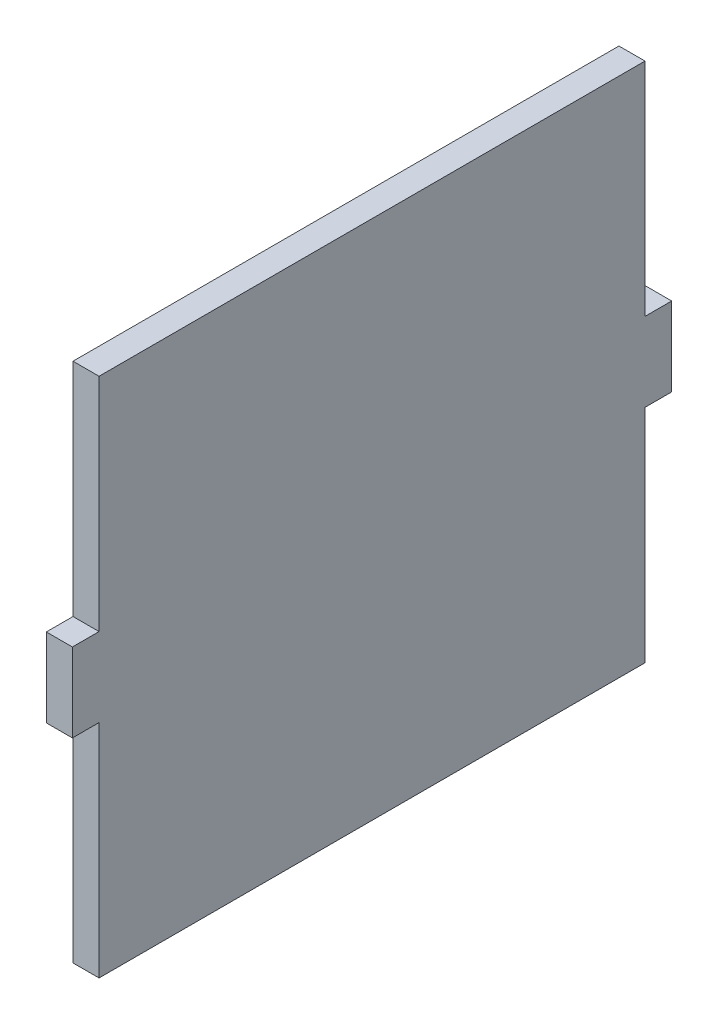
ISO-10303-21;
HEADER;
FILE_DESCRIPTION(('STEP AP214'),'2;1');
FILE_NAME('part.step','',(''),(''),'','','');
FILE_SCHEMA(('AUTOMOTIVE_DESIGN { 1 0 10303 214 1 1 1 1 }'));
ENDSEC;
DATA;
#1=APPLICATION_CONTEXT('core data for automotive mechanical design processes');
#2=APPLICATION_PROTOCOL_DEFINITION('international standard','automotive_design',2000,#1);
#3=PRODUCT_CONTEXT('',#1,'mechanical');
#4=PRODUCT('Part','Part','',(#3));
#5=PRODUCT_RELATED_PRODUCT_CATEGORY('part','',(#4));
#6=PRODUCT_DEFINITION_FORMATION('','',#4);
#7=PRODUCT_DEFINITION_CONTEXT('part definition',#1,'design');
#8=PRODUCT_DEFINITION('design','',#6,#7);
#9=PRODUCT_DEFINITION_SHAPE('','',#8);
#10=(LENGTH_UNIT() NAMED_UNIT(*) SI_UNIT(.MILLI.,.METRE.));
#11=(NAMED_UNIT(*) PLANE_ANGLE_UNIT() SI_UNIT($,.RADIAN.));
#12=(NAMED_UNIT(*) SI_UNIT($,.STERADIAN.) SOLID_ANGLE_UNIT());
#13=UNCERTAINTY_MEASURE_WITH_UNIT(LENGTH_MEASURE(1.E-05),#10,'distance_accuracy_value','');
#14=(GEOMETRIC_REPRESENTATION_CONTEXT(3) GLOBAL_UNCERTAINTY_ASSIGNED_CONTEXT((#13)) GLOBAL_UNIT_ASSIGNED_CONTEXT((#10,
#11,#12)) REPRESENTATION_CONTEXT('',''));
#15=CARTESIAN_POINT('',(0.,0.,0.));
#16=DIRECTION('',(0.,0.,1.));
#17=DIRECTION('',(1.,0.,0.));
#18=AXIS2_PLACEMENT_3D('',#15,#16,#17);
#19=CARTESIAN_POINT('',(10.,53.319129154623,80.3372117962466));
#20=DIRECTION('',(0.,0.,-1.));
#21=DIRECTION('',(0.,1.,0.));
#22=AXIS2_PLACEMENT_3D('',#19,#20,#21);
#23=PLANE('',#22);
#24=DIRECTION('',(0.,-1.,0.));
#25=VECTOR('',#24,1.);
#26=CARTESIAN_POINT('',(0.,53.319129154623,80.3372117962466));
#27=LINE('',#26,#25);
#28=CARTESIAN_POINT('',(0.,53.319129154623,80.3372117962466));
#29=VERTEX_POINT('',#28);
#30=CARTESIAN_POINT('',(0.,-31.5408708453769,80.3372117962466));
#31=VERTEX_POINT('',#30);
#32=EDGE_CURVE('E248',#29,#31,#27,.T.);
#33=ORIENTED_EDGE('',*,*,#32,.T.);
#34=DIRECTION('',(-1.,0.,0.));
#35=VECTOR('',#34,1.);
#36=CARTESIAN_POINT('',(10.,-31.5408708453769,80.3372117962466));
#37=LINE('',#36,#35);
#38=CARTESIAN_POINT('',(10.,-31.5408708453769,80.3372117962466));
#39=VERTEX_POINT('',#38);
#40=EDGE_CURVE('E12',#39,#31,#37,.T.);
#41=ORIENTED_EDGE('',*,*,#40,.F.);
#42=DIRECTION('',(0.,-1.,0.));
#43=VECTOR('',#42,1.);
#44=CARTESIAN_POINT('',(10.,53.319129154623,80.3372117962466));
#45=LINE('',#44,#43);
#46=CARTESIAN_POINT('',(10.,53.319129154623,80.3372117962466));
#47=VERTEX_POINT('',#46);
#48=EDGE_CURVE('E201',#47,#39,#45,.T.);
#49=ORIENTED_EDGE('',*,*,#48,.F.);
#50=DIRECTION('',(-1.,0.,0.));
#51=VECTOR('',#50,1.);
#52=CARTESIAN_POINT('',(10.,53.319129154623,80.3372117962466));
#53=LINE('',#52,#51);
#54=EDGE_CURVE('E157',#47,#29,#53,.T.);
#55=ORIENTED_EDGE('',*,*,#54,.T.);
#56=EDGE_LOOP('',(#33,#41,#49,#55));
#57=FACE_BOUND('',#56,.T.);
#58=ADVANCED_FACE('F38',(#57),#23,.F.);
#59=CARTESIAN_POINT('',(10.,-31.5408708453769,80.3372117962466));
#60=DIRECTION('',(0.,-1.,0.));
#61=DIRECTION('',(0.,0.,-1.));
#62=AXIS2_PLACEMENT_3D('',#59,#60,#61);
#63=PLANE('',#62);
#64=DIRECTION('',(0.,0.,1.));
#65=VECTOR('',#64,1.);
#66=CARTESIAN_POINT('',(0.,-31.5408708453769,80.3372117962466));
#67=LINE('',#66,#65);
#68=CARTESIAN_POINT('',(0.,-31.5408708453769,90.5772117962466));
#69=VERTEX_POINT('',#68);
#70=EDGE_CURVE('E242',#31,#69,#67,.T.);
#71=ORIENTED_EDGE('',*,*,#70,.T.);
#72=DIRECTION('',(-1.,0.,0.));
#73=VECTOR('',#72,1.);
#74=CARTESIAN_POINT('',(10.,-31.5408708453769,90.5772117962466));
#75=LINE('',#74,#73);
#76=CARTESIAN_POINT('',(10.,-31.5408708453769,90.5772117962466));
#77=VERTEX_POINT('',#76);
#78=EDGE_CURVE('E46',#77,#69,#75,.T.);
#79=ORIENTED_EDGE('',*,*,#78,.F.);
#80=DIRECTION('',(0.,0.,1.));
#81=VECTOR('',#80,1.);
#82=CARTESIAN_POINT('',(10.,-31.5408708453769,80.3372117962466));
#83=LINE('',#82,#81);
#84=EDGE_CURVE('E109',#39,#77,#83,.T.);
#85=ORIENTED_EDGE('',*,*,#84,.F.);
#86=ORIENTED_EDGE('',*,*,#40,.T.);
#87=EDGE_LOOP('',(#71,#79,#85,#86));
#88=FACE_BOUND('',#87,.T.);
#89=ADVANCED_FACE('F277',(#88),#63,.F.);
#90=CARTESIAN_POINT('',(10.,-31.5408708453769,90.5772117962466));
#91=DIRECTION('',(0.,0.,-1.));
#92=DIRECTION('',(0.,1.,0.));
#93=AXIS2_PLACEMENT_3D('',#90,#91,#92);
#94=PLANE('',#93);
#95=DIRECTION('',(0.,-1.,0.));
#96=VECTOR('',#95,1.);
#97=CARTESIAN_POINT('',(0.,-31.5408708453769,90.5772117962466));
#98=LINE('',#97,#96);
#99=CARTESIAN_POINT('',(0.,-61.7808708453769,90.5772117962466));
#100=VERTEX_POINT('',#99);
#101=EDGE_CURVE('E237',#69,#100,#98,.T.);
#102=ORIENTED_EDGE('',*,*,#101,.T.);
#103=DIRECTION('',(-1.,0.,0.));
#104=VECTOR('',#103,1.);
#105=CARTESIAN_POINT('',(10.,-61.7808708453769,90.5772117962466));
#106=LINE('',#105,#104);
#107=CARTESIAN_POINT('',(10.,-61.7808708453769,90.5772117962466));
#108=VERTEX_POINT('',#107);
#109=EDGE_CURVE('E229',#108,#100,#106,.T.);
#110=ORIENTED_EDGE('',*,*,#109,.F.);
#111=DIRECTION('',(0.,-1.,0.));
#112=VECTOR('',#111,1.);
#113=CARTESIAN_POINT('',(10.,-31.5408708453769,90.5772117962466));
#114=LINE('',#113,#112);
#115=EDGE_CURVE('E193',#77,#108,#114,.T.);
#116=ORIENTED_EDGE('',*,*,#115,.F.);
#117=ORIENTED_EDGE('',*,*,#78,.T.);
#118=EDGE_LOOP('',(#102,#110,#116,#117));
#119=FACE_BOUND('',#118,.T.);
#120=ADVANCED_FACE('F235',(#119),#94,.F.);
#121=CARTESIAN_POINT('',(10.,-61.7808708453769,90.5772117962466));
#122=DIRECTION('',(0.,1.,0.));
#123=DIRECTION('',(0.,0.,1.));
#124=AXIS2_PLACEMENT_3D('',#121,#122,#123);
#125=PLANE('',#124);
#126=DIRECTION('',(0.,0.,-1.));
#127=VECTOR('',#126,1.);
#128=CARTESIAN_POINT('',(0.,-61.7808708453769,90.5772117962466));
#129=LINE('',#128,#127);
#130=CARTESIAN_POINT('',(0.,-61.7808708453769,80.3372117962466));
#131=VERTEX_POINT('',#130);
#132=EDGE_CURVE('E244',#100,#131,#129,.T.);
#133=ORIENTED_EDGE('',*,*,#132,.T.);
#134=DIRECTION('',(-1.,0.,0.));
#135=VECTOR('',#134,1.);
#136=CARTESIAN_POINT('',(10.,-61.7808708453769,80.3372117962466));
#137=LINE('',#136,#135);
#138=CARTESIAN_POINT('',(10.,-61.7808708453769,80.3372117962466));
#139=VERTEX_POINT('',#138);
#140=EDGE_CURVE('E226',#139,#131,#137,.T.);
#141=ORIENTED_EDGE('',*,*,#140,.F.);
#142=DIRECTION('',(0.,0.,-1.));
#143=VECTOR('',#142,1.);
#144=CARTESIAN_POINT('',(10.,-61.7808708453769,90.5772117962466));
#145=LINE('',#144,#143);
#146=EDGE_CURVE('E189',#108,#139,#145,.T.);
#147=ORIENTED_EDGE('',*,*,#146,.F.);
#148=ORIENTED_EDGE('',*,*,#109,.T.);
#149=EDGE_LOOP('',(#133,#141,#147,#148));
#150=FACE_BOUND('',#149,.T.);
#151=ADVANCED_FACE('F284',(#150),#125,.F.);
#152=CARTESIAN_POINT('',(10.,-61.7808708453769,80.3372117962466));
#153=DIRECTION('',(0.,0.,-1.));
#154=DIRECTION('',(0.,1.,0.));
#155=AXIS2_PLACEMENT_3D('',#152,#153,#154);
#156=PLANE('',#155);
#157=DIRECTION('',(0.,-1.,0.));
#158=VECTOR('',#157,1.);
#159=CARTESIAN_POINT('',(0.,-61.7808708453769,80.3372117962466));
#160=LINE('',#159,#158);
#161=CARTESIAN_POINT('',(0.,-146.680870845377,80.3372117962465));
#162=VERTEX_POINT('',#161);
#163=EDGE_CURVE('E246',#131,#162,#160,.T.);
#164=ORIENTED_EDGE('',*,*,#163,.T.);
#165=DIRECTION('',(-1.,0.,0.));
#166=VECTOR('',#165,1.);
#167=CARTESIAN_POINT('',(10.,-146.680870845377,80.3372117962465));
#168=LINE('',#167,#166);
#169=CARTESIAN_POINT('',(10.,-146.680870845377,80.3372117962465));
#170=VERTEX_POINT('',#169);
#171=EDGE_CURVE('E223',#170,#162,#168,.T.);
#172=ORIENTED_EDGE('',*,*,#171,.F.);
#173=DIRECTION('',(0.,-1.,0.));
#174=VECTOR('',#173,1.);
#175=CARTESIAN_POINT('',(10.,-61.7808708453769,80.3372117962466));
#176=LINE('',#175,#174);
#177=EDGE_CURVE('E186',#139,#170,#176,.T.);
#178=ORIENTED_EDGE('',*,*,#177,.F.);
#179=ORIENTED_EDGE('',*,*,#140,.T.);
#180=EDGE_LOOP('',(#164,#172,#178,#179));
#181=FACE_BOUND('',#180,.T.);
#182=ADVANCED_FACE('F289',(#181),#156,.F.);
#183=CARTESIAN_POINT('',(10.,-146.680870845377,80.3372117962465));
#184=DIRECTION('',(0.,1.,0.));
#185=DIRECTION('',(0.,0.,1.));
#186=AXIS2_PLACEMENT_3D('',#183,#184,#185);
#187=PLANE('',#186);
#188=DIRECTION('',(0.,0.,-1.));
#189=VECTOR('',#188,1.);
#190=CARTESIAN_POINT('',(0.,-146.680870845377,80.3372117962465));
#191=LINE('',#190,#189);
#192=CARTESIAN_POINT('',(0.,-146.680870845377,-129.182788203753));
#193=VERTEX_POINT('',#192);
#194=EDGE_CURVE('E252',#162,#193,#191,.T.);
#195=ORIENTED_EDGE('',*,*,#194,.T.);
#196=DIRECTION('',(-1.,0.,0.));
#197=VECTOR('',#196,1.);
#198=CARTESIAN_POINT('',(10.,-146.680870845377,-129.182788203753));
#199=LINE('',#198,#197);
#200=CARTESIAN_POINT('',(10.,-146.680870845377,-129.182788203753));
#201=VERTEX_POINT('',#200);
#202=EDGE_CURVE('E220',#201,#193,#199,.T.);
#203=ORIENTED_EDGE('',*,*,#202,.F.);
#204=DIRECTION('',(0.,0.,-1.));
#205=VECTOR('',#204,1.);
#206=CARTESIAN_POINT('',(10.,-146.680870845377,80.3372117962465));
#207=LINE('',#206,#205);
#208=EDGE_CURVE('E178',#170,#201,#207,.T.);
#209=ORIENTED_EDGE('',*,*,#208,.F.);
#210=ORIENTED_EDGE('',*,*,#171,.T.);
#211=EDGE_LOOP('',(#195,#203,#209,#210));
#212=FACE_BOUND('',#211,.T.);
#213=ADVANCED_FACE('F293',(#212),#187,.F.);
#214=CARTESIAN_POINT('',(10.,-61.7808708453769,-129.182788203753));
#215=DIRECTION('',(0.,0.,1.));
#216=DIRECTION('',(1.,0.,0.));
#217=AXIS2_PLACEMENT_3D('',#214,#215,#216);
#218=PLANE('',#217);
#219=DIRECTION('',(0.,1.,0.));
#220=VECTOR('',#219,1.);
#221=CARTESIAN_POINT('',(0.,-61.7808708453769,-129.182788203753));
#222=LINE('',#221,#220);
#223=CARTESIAN_POINT('',(0.,-61.7808708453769,-129.182788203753));
#224=VERTEX_POINT('',#223);
#225=EDGE_CURVE('E254',#193,#224,#222,.T.);
#226=ORIENTED_EDGE('',*,*,#225,.T.);
#227=DIRECTION('',(-1.,0.,0.));
#228=VECTOR('',#227,1.);
#229=CARTESIAN_POINT('',(10.,-61.7808708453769,-129.182788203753));
#230=LINE('',#229,#228);
#231=CARTESIAN_POINT('',(10.,-61.7808708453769,-129.182788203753));
#232=VERTEX_POINT('',#231);
#233=EDGE_CURVE('E217',#232,#224,#230,.T.);
#234=ORIENTED_EDGE('',*,*,#233,.F.);
#235=DIRECTION('',(0.,1.,0.));
#236=VECTOR('',#235,1.);
#237=CARTESIAN_POINT('',(10.,-61.7808708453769,-129.182788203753));
#238=LINE('',#237,#236);
#239=EDGE_CURVE('E174',#201,#232,#238,.T.);
#240=ORIENTED_EDGE('',*,*,#239,.F.);
#241=ORIENTED_EDGE('',*,*,#202,.T.);
#242=EDGE_LOOP('',(#226,#234,#240,#241));
#243=FACE_BOUND('',#242,.T.);
#244=ADVANCED_FACE('F297',(#243),#218,.F.);
#245=CARTESIAN_POINT('',(10.,-61.7808708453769,-139.422788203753));
#246=DIRECTION('',(0.,1.,0.));
#247=DIRECTION('',(0.,0.,1.));
#248=AXIS2_PLACEMENT_3D('',#245,#246,#247);
#249=PLANE('',#248);
#250=DIRECTION('',(0.,0.,-1.));
#251=VECTOR('',#250,1.);
#252=CARTESIAN_POINT('',(0.,-61.7808708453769,-139.422788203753));
#253=LINE('',#252,#251);
#254=CARTESIAN_POINT('',(0.,-61.7808708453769,-139.422788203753));
#255=VERTEX_POINT('',#254);
#256=EDGE_CURVE('E256',#224,#255,#253,.T.);
#257=ORIENTED_EDGE('',*,*,#256,.T.);
#258=DIRECTION('',(-1.,0.,0.));
#259=VECTOR('',#258,1.);
#260=CARTESIAN_POINT('',(10.,-61.7808708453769,-139.422788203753));
#261=LINE('',#260,#259);
#262=CARTESIAN_POINT('',(10.,-61.7808708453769,-139.422788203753));
#263=VERTEX_POINT('',#262);
#264=EDGE_CURVE('E214',#263,#255,#261,.T.);
#265=ORIENTED_EDGE('',*,*,#264,.F.);
#266=DIRECTION('',(0.,0.,-1.));
#267=VECTOR('',#266,1.);
#268=CARTESIAN_POINT('',(10.,-61.7808708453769,-139.422788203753));
#269=LINE('',#268,#267);
#270=EDGE_CURVE('E170',#232,#263,#269,.T.);
#271=ORIENTED_EDGE('',*,*,#270,.F.);
#272=ORIENTED_EDGE('',*,*,#233,.T.);
#273=EDGE_LOOP('',(#257,#265,#271,#272));
#274=FACE_BOUND('',#273,.T.);
#275=ADVANCED_FACE('F301',(#274),#249,.F.);
#276=CARTESIAN_POINT('',(10.,-31.5408708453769,-139.422788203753));
#277=DIRECTION('',(0.,0.,1.));
#278=DIRECTION('',(1.,0.,0.));
#279=AXIS2_PLACEMENT_3D('',#276,#277,#278);
#280=PLANE('',#279);
#281=DIRECTION('',(0.,1.,0.));
#282=VECTOR('',#281,1.);
#283=CARTESIAN_POINT('',(0.,-31.5408708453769,-139.422788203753));
#284=LINE('',#283,#282);
#285=CARTESIAN_POINT('',(0.,-31.5408708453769,-139.422788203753));
#286=VERTEX_POINT('',#285);
#287=EDGE_CURVE('E258',#255,#286,#284,.T.);
#288=ORIENTED_EDGE('',*,*,#287,.T.);
#289=DIRECTION('',(-1.,0.,0.));
#290=VECTOR('',#289,1.);
#291=CARTESIAN_POINT('',(10.,-31.5408708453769,-139.422788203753));
#292=LINE('',#291,#290);
#293=CARTESIAN_POINT('',(10.,-31.5408708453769,-139.422788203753));
#294=VERTEX_POINT('',#293);
#295=EDGE_CURVE('E150',#294,#286,#292,.T.);
#296=ORIENTED_EDGE('',*,*,#295,.F.);
#297=DIRECTION('',(0.,1.,0.));
#298=VECTOR('',#297,1.);
#299=CARTESIAN_POINT('',(10.,-31.5408708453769,-139.422788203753));
#300=LINE('',#299,#298);
#301=EDGE_CURVE('E140',#263,#294,#300,.T.);
#302=ORIENTED_EDGE('',*,*,#301,.F.);
#303=ORIENTED_EDGE('',*,*,#264,.T.);
#304=EDGE_LOOP('',(#288,#296,#302,#303));
#305=FACE_BOUND('',#304,.T.);
#306=ADVANCED_FACE('F261',(#305),#280,.F.);
#307=CARTESIAN_POINT('',(10.,-31.5408708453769,-129.182788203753));
#308=DIRECTION('',(0.,-1.,0.));
#309=DIRECTION('',(0.,0.,-1.));
#310=AXIS2_PLACEMENT_3D('',#307,#308,#309);
#311=PLANE('',#310);
#312=DIRECTION('',(0.,0.,1.));
#313=VECTOR('',#312,1.);
#314=CARTESIAN_POINT('',(0.,-31.5408708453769,-129.182788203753));
#315=LINE('',#314,#313);
#316=CARTESIAN_POINT('',(0.,-31.5408708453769,-129.182788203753));
#317=VERTEX_POINT('',#316);
#318=EDGE_CURVE('E149',#286,#317,#315,.T.);
#319=ORIENTED_EDGE('',*,*,#318,.T.);
#320=DIRECTION('',(-1.,0.,0.));
#321=VECTOR('',#320,1.);
#322=CARTESIAN_POINT('',(10.,-31.5408708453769,-129.182788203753));
#323=LINE('',#322,#321);
#324=CARTESIAN_POINT('',(10.,-31.5408708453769,-129.182788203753));
#325=VERTEX_POINT('',#324);
#326=EDGE_CURVE('E146',#325,#317,#323,.T.);
#327=ORIENTED_EDGE('',*,*,#326,.F.);
#328=DIRECTION('',(0.,0.,1.));
#329=VECTOR('',#328,1.);
#330=CARTESIAN_POINT('',(10.,-31.5408708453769,-129.182788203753));
#331=LINE('',#330,#329);
#332=EDGE_CURVE('E134',#294,#325,#331,.T.);
#333=ORIENTED_EDGE('',*,*,#332,.F.);
#334=ORIENTED_EDGE('',*,*,#295,.T.);
#335=EDGE_LOOP('',(#319,#327,#333,#334));
#336=FACE_BOUND('',#335,.T.);
#337=ADVANCED_FACE('F147',(#336),#311,.F.);
#338=CARTESIAN_POINT('',(10.,53.3191291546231,-129.182788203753));
#339=DIRECTION('',(0.,0.,1.));
#340=DIRECTION('',(1.,0.,0.));
#341=AXIS2_PLACEMENT_3D('',#338,#339,#340);
#342=PLANE('',#341);
#343=DIRECTION('',(0.,1.,0.));
#344=VECTOR('',#343,1.);
#345=CARTESIAN_POINT('',(0.,53.3191291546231,-129.182788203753));
#346=LINE('',#345,#344);
#347=CARTESIAN_POINT('',(0.,53.3191291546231,-129.182788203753));
#348=VERTEX_POINT('',#347);
#349=EDGE_CURVE('E95',#317,#348,#346,.T.);
#350=ORIENTED_EDGE('',*,*,#349,.T.);
#351=DIRECTION('',(-1.,0.,0.));
#352=VECTOR('',#351,1.);
#353=CARTESIAN_POINT('',(10.,53.3191291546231,-129.182788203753));
#354=LINE('',#353,#352);
#355=CARTESIAN_POINT('',(10.,53.3191291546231,-129.182788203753));
#356=VERTEX_POINT('',#355);
#357=EDGE_CURVE('E151',#356,#348,#354,.T.);
#358=ORIENTED_EDGE('',*,*,#357,.F.);
#359=DIRECTION('',(0.,1.,0.));
#360=VECTOR('',#359,1.);
#361=CARTESIAN_POINT('',(10.,53.3191291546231,-129.182788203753));
#362=LINE('',#361,#360);
#363=EDGE_CURVE('E138',#325,#356,#362,.T.);
#364=ORIENTED_EDGE('',*,*,#363,.F.);
#365=ORIENTED_EDGE('',*,*,#326,.T.);
#366=EDGE_LOOP('',(#350,#358,#364,#365));
#367=FACE_BOUND('',#366,.T.);
#368=ADVANCED_FACE('F153',(#367),#342,.F.);
#369=CARTESIAN_POINT('',(10.,53.319129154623,80.3372117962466));
#370=DIRECTION('',(0.,-1.,0.));
#371=DIRECTION('',(0.,0.,-1.));
#372=AXIS2_PLACEMENT_3D('',#369,#370,#371);
#373=PLANE('',#372);
#374=DIRECTION('',(0.,0.,1.));
#375=VECTOR('',#374,1.);
#376=CARTESIAN_POINT('',(0.,53.319129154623,80.3372117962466));
#377=LINE('',#376,#375);
#378=EDGE_CURVE('E101',#348,#29,#377,.T.);
#379=ORIENTED_EDGE('',*,*,#378,.T.);
#380=ORIENTED_EDGE('',*,*,#54,.F.);
#381=DIRECTION('',(0.,0.,1.));
#382=VECTOR('',#381,1.);
#383=CARTESIAN_POINT('',(10.,53.319129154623,80.3372117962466));
#384=LINE('',#383,#382);
#385=EDGE_CURVE('E54',#356,#47,#384,.T.);
#386=ORIENTED_EDGE('',*,*,#385,.F.);
#387=ORIENTED_EDGE('',*,*,#357,.T.);
#388=EDGE_LOOP('',(#379,#380,#386,#387));
#389=FACE_BOUND('',#388,.T.);
#390=ADVANCED_FACE('F266',(#389),#373,.F.);
#391=CARTESIAN_POINT('',(10.,0.,0.));
#392=DIRECTION('',(-1.,0.,0.));
#393=DIRECTION('',(0.,0.,1.));
#394=AXIS2_PLACEMENT_3D('',#391,#392,#393);
#395=PLANE('',#394);
#396=ORIENTED_EDGE('',*,*,#48,.T.);
#397=ORIENTED_EDGE('',*,*,#84,.T.);
#398=ORIENTED_EDGE('',*,*,#115,.T.);
#399=ORIENTED_EDGE('',*,*,#146,.T.);
#400=ORIENTED_EDGE('',*,*,#177,.T.);
#401=ORIENTED_EDGE('',*,*,#208,.T.);
#402=ORIENTED_EDGE('',*,*,#239,.T.);
#403=ORIENTED_EDGE('',*,*,#270,.T.);
#404=ORIENTED_EDGE('',*,*,#301,.T.);
#405=ORIENTED_EDGE('',*,*,#332,.T.);
#406=ORIENTED_EDGE('',*,*,#363,.T.);
#407=ORIENTED_EDGE('',*,*,#385,.T.);
#408=EDGE_LOOP('',(#396,#397,#398,#399,#400,#401,#402,#403,#404,#405,#406,#407));
#409=FACE_BOUND('',#408,.T.);
#410=ADVANCED_FACE('F136',(#409),#395,.F.);
#411=CARTESIAN_POINT('',(0.,0.,0.));
#412=DIRECTION('',(-1.,0.,0.));
#413=DIRECTION('',(0.,0.,1.));
#414=AXIS2_PLACEMENT_3D('',#411,#412,#413);
#415=PLANE('',#414);
#416=ORIENTED_EDGE('',*,*,#32,.F.);
#417=ORIENTED_EDGE('',*,*,#378,.F.);
#418=ORIENTED_EDGE('',*,*,#349,.F.);
#419=ORIENTED_EDGE('',*,*,#318,.F.);
#420=ORIENTED_EDGE('',*,*,#287,.F.);
#421=ORIENTED_EDGE('',*,*,#256,.F.);
#422=ORIENTED_EDGE('',*,*,#225,.F.);
#423=ORIENTED_EDGE('',*,*,#194,.F.);
#424=ORIENTED_EDGE('',*,*,#163,.F.);
#425=ORIENTED_EDGE('',*,*,#132,.F.);
#426=ORIENTED_EDGE('',*,*,#101,.F.);
#427=ORIENTED_EDGE('',*,*,#70,.F.);
#428=EDGE_LOOP('',(#416,#417,#418,#419,#420,#421,#422,#423,#424,#425,#426,#427));
#429=FACE_BOUND('',#428,.T.);
#430=ADVANCED_FACE('F241',(#429),#415,.T.);
#431=CLOSED_SHELL('',(#58,#89,#120,#151,#182,#213,#244,#275,#306,#337,#368,#390,#410,#430));
#432=MANIFOLD_SOLID_BREP('B2',#431);
#433=ADVANCED_BREP_SHAPE_REPRESENTATION('',(#18,#432),#14);
#434=SHAPE_DEFINITION_REPRESENTATION(#9,#433);
ENDSEC;
END-ISO-10303-21;
